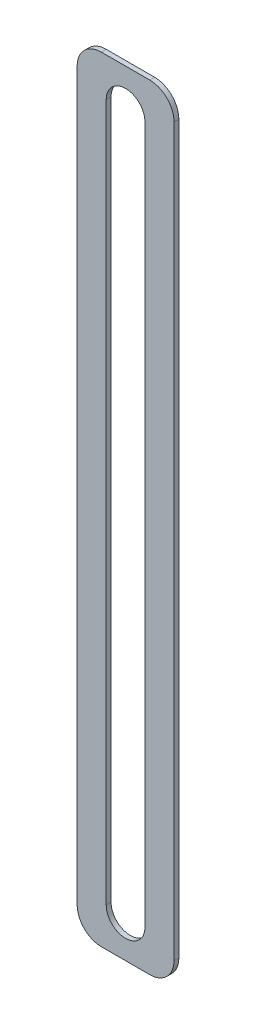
ISO-10303-21;
HEADER;
FILE_DESCRIPTION(('STEP AP214'),'2;1');
FILE_NAME('part.step','',(''),(''),'','','');
FILE_SCHEMA(('AUTOMOTIVE_DESIGN { 1 0 10303 214 1 1 1 1 }'));
ENDSEC;
DATA;
#1=APPLICATION_CONTEXT('core data for automotive mechanical design processes');
#2=APPLICATION_PROTOCOL_DEFINITION('international standard','automotive_design',2000,#1);
#3=PRODUCT_CONTEXT('',#1,'mechanical');
#4=PRODUCT('Part','Part','',(#3));
#5=PRODUCT_RELATED_PRODUCT_CATEGORY('part','',(#4));
#6=PRODUCT_DEFINITION_FORMATION('','',#4);
#7=PRODUCT_DEFINITION_CONTEXT('part definition',#1,'design');
#8=PRODUCT_DEFINITION('design','',#6,#7);
#9=PRODUCT_DEFINITION_SHAPE('','',#8);
#10=(LENGTH_UNIT() NAMED_UNIT(*) SI_UNIT(.MILLI.,.METRE.));
#11=(NAMED_UNIT(*) PLANE_ANGLE_UNIT() SI_UNIT($,.RADIAN.));
#12=(NAMED_UNIT(*) SI_UNIT($,.STERADIAN.) SOLID_ANGLE_UNIT());
#13=UNCERTAINTY_MEASURE_WITH_UNIT(LENGTH_MEASURE(1.E-05),#10,'distance_accuracy_value','');
#14=(GEOMETRIC_REPRESENTATION_CONTEXT(3) GLOBAL_UNCERTAINTY_ASSIGNED_CONTEXT((#13)) GLOBAL_UNIT_ASSIGNED_CONTEXT((#10,
#11,#12)) REPRESENTATION_CONTEXT('',''));
#15=CARTESIAN_POINT('',(0.,0.,0.));
#16=DIRECTION('',(0.,0.,1.));
#17=DIRECTION('',(1.,0.,0.));
#18=AXIS2_PLACEMENT_3D('',#15,#16,#17);
#19=CARTESIAN_POINT('',(2.50000000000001,-37.4999999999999,0.5));
#20=DIRECTION('',(0.,0.,-1.));
#21=DIRECTION('',(-1.,0.,0.));
#22=AXIS2_PLACEMENT_3D('',#19,#20,#21);
#23=CYLINDRICAL_SURFACE('',#22,2.5);
#24=CARTESIAN_POINT('',(2.50000000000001,-37.4999999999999,0.));
#25=DIRECTION('',(0.,0.,-1.));
#26=DIRECTION('',(-1.,0.,0.));
#27=AXIS2_PLACEMENT_3D('',#24,#25,#26);
#28=CIRCLE('',#27,2.5);
#29=CARTESIAN_POINT('',(5.00000000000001,-37.4999999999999,0.));
#30=VERTEX_POINT('',#29);
#31=CARTESIAN_POINT('',(2.50000000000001,-39.9999999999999,0.));
#32=VERTEX_POINT('',#31);
#33=EDGE_CURVE('E212',#30,#32,#28,.T.);
#34=ORIENTED_EDGE('',*,*,#33,.F.);
#35=DIRECTION('',(0.,0.,-1.));
#36=VECTOR('',#35,1.);
#37=CARTESIAN_POINT('',(5.00000000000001,-37.4999999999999,0.5));
#38=LINE('',#37,#36);
#39=CARTESIAN_POINT('',(5.00000000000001,-37.4999999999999,0.5));
#40=VERTEX_POINT('',#39);
#41=EDGE_CURVE('E12',#40,#30,#38,.T.);
#42=ORIENTED_EDGE('',*,*,#41,.F.);
#43=CARTESIAN_POINT('',(2.50000000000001,-37.4999999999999,0.5));
#44=DIRECTION('',(0.,0.,-1.));
#45=DIRECTION('',(-1.,0.,0.));
#46=AXIS2_PLACEMENT_3D('',#43,#44,#45);
#47=CIRCLE('',#46,2.5);
#48=CARTESIAN_POINT('',(2.50000000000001,-39.9999999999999,0.5));
#49=VERTEX_POINT('',#48);
#50=EDGE_CURVE('E218',#40,#49,#47,.T.);
#51=ORIENTED_EDGE('',*,*,#50,.T.);
#52=DIRECTION('',(0.,0.,-1.));
#53=VECTOR('',#52,1.);
#54=CARTESIAN_POINT('',(2.50000000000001,-39.9999999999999,0.5));
#55=LINE('',#54,#53);
#56=EDGE_CURVE('E84',#49,#32,#55,.T.);
#57=ORIENTED_EDGE('',*,*,#56,.T.);
#58=EDGE_LOOP('',(#34,#42,#51,#57));
#59=FACE_BOUND('',#58,.T.);
#60=ADVANCED_FACE('F81',(#59),#23,.T.);
#61=CARTESIAN_POINT('',(5.,37.5000000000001,0.5));
#62=DIRECTION('',(1.,0.,0.));
#63=DIRECTION('',(0.,1.,0.));
#64=AXIS2_PLACEMENT_3D('',#61,#62,#63);
#65=PLANE('',#64);
#66=DIRECTION('',(0.,-1.,0.));
#67=VECTOR('',#66,1.);
#68=CARTESIAN_POINT('',(5.,37.5000000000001,0.));
#69=LINE('',#68,#67);
#70=CARTESIAN_POINT('',(5.,37.5000000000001,0.));
#71=VERTEX_POINT('',#70);
#72=EDGE_CURVE('E223',#71,#30,#69,.T.);
#73=ORIENTED_EDGE('',*,*,#72,.F.);
#74=DIRECTION('',(0.,0.,-1.));
#75=VECTOR('',#74,1.);
#76=CARTESIAN_POINT('',(5.,37.5000000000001,0.5));
#77=LINE('',#76,#75);
#78=CARTESIAN_POINT('',(5.,37.5000000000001,0.5));
#79=VERTEX_POINT('',#78);
#80=EDGE_CURVE('E90',#79,#71,#77,.T.);
#81=ORIENTED_EDGE('',*,*,#80,.F.);
#82=DIRECTION('',(0.,-1.,0.));
#83=VECTOR('',#82,1.);
#84=CARTESIAN_POINT('',(5.,37.5000000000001,0.5));
#85=LINE('',#84,#83);
#86=EDGE_CURVE('E243',#79,#40,#85,.T.);
#87=ORIENTED_EDGE('',*,*,#86,.T.);
#88=ORIENTED_EDGE('',*,*,#41,.T.);
#89=EDGE_LOOP('',(#73,#81,#87,#88));
#90=FACE_BOUND('',#89,.T.);
#91=ADVANCED_FACE('F308',(#90),#65,.T.);
#92=CARTESIAN_POINT('',(2.5,37.5000000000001,0.5));
#93=DIRECTION('',(0.,0.,-1.));
#94=DIRECTION('',(-1.,0.,0.));
#95=AXIS2_PLACEMENT_3D('',#92,#93,#94);
#96=CYLINDRICAL_SURFACE('',#95,2.5);
#97=CARTESIAN_POINT('',(2.5,37.5000000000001,0.));
#98=DIRECTION('',(0.,0.,-1.));
#99=DIRECTION('',(-1.,0.,0.));
#100=AXIS2_PLACEMENT_3D('',#97,#98,#99);
#101=CIRCLE('',#100,2.5);
#102=CARTESIAN_POINT('',(2.5,40.0000000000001,0.));
#103=VERTEX_POINT('',#102);
#104=EDGE_CURVE('E267',#103,#71,#101,.T.);
#105=ORIENTED_EDGE('',*,*,#104,.F.);
#106=DIRECTION('',(0.,0.,-1.));
#107=VECTOR('',#106,1.);
#108=CARTESIAN_POINT('',(2.5,40.0000000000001,0.5));
#109=LINE('',#108,#107);
#110=CARTESIAN_POINT('',(2.5,40.0000000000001,0.5));
#111=VERTEX_POINT('',#110);
#112=EDGE_CURVE('E276',#111,#103,#109,.T.);
#113=ORIENTED_EDGE('',*,*,#112,.F.);
#114=CARTESIAN_POINT('',(2.5,37.5000000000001,0.5));
#115=DIRECTION('',(0.,0.,-1.));
#116=DIRECTION('',(-1.,0.,0.));
#117=AXIS2_PLACEMENT_3D('',#114,#115,#116);
#118=CIRCLE('',#117,2.5);
#119=EDGE_CURVE('E239',#111,#79,#118,.T.);
#120=ORIENTED_EDGE('',*,*,#119,.T.);
#121=ORIENTED_EDGE('',*,*,#80,.T.);
#122=EDGE_LOOP('',(#105,#113,#120,#121));
#123=FACE_BOUND('',#122,.T.);
#124=ADVANCED_FACE('F329',(#123),#96,.T.);
#125=CARTESIAN_POINT('',(2.5,40.0000000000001,0.5));
#126=DIRECTION('',(0.,-1.,0.));
#127=DIRECTION('',(0.,0.,-1.));
#128=AXIS2_PLACEMENT_3D('',#125,#126,#127);
#129=PLANE('',#128);
#130=DIRECTION('',(-1.,0.,0.));
#131=VECTOR('',#130,1.);
#132=CARTESIAN_POINT('',(2.5,40.0000000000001,0.));
#133=LINE('',#132,#131);
#134=CARTESIAN_POINT('',(-2.5,40.0000000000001,0.));
#135=VERTEX_POINT('',#134);
#136=EDGE_CURVE('E264',#103,#135,#133,.T.);
#137=ORIENTED_EDGE('',*,*,#136,.T.);
#138=DIRECTION('',(0.,0.,-1.));
#139=VECTOR('',#138,1.);
#140=CARTESIAN_POINT('',(-2.5,40.0000000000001,0.5));
#141=LINE('',#140,#139);
#142=CARTESIAN_POINT('',(-2.5,40.0000000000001,0.5));
#143=VERTEX_POINT('',#142);
#144=EDGE_CURVE('E279',#143,#135,#141,.T.);
#145=ORIENTED_EDGE('',*,*,#144,.F.);
#146=DIRECTION('',(-1.,0.,0.));
#147=VECTOR('',#146,1.);
#148=CARTESIAN_POINT('',(2.5,40.0000000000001,0.5));
#149=LINE('',#148,#147);
#150=EDGE_CURVE('E236',#111,#143,#149,.T.);
#151=ORIENTED_EDGE('',*,*,#150,.F.);
#152=ORIENTED_EDGE('',*,*,#112,.T.);
#153=EDGE_LOOP('',(#137,#145,#151,#152));
#154=FACE_BOUND('',#153,.T.);
#155=ADVANCED_FACE('F327',(#154),#129,.F.);
#156=CARTESIAN_POINT('',(-2.5,37.5000000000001,0.5));
#157=DIRECTION('',(0.,0.,-1.));
#158=DIRECTION('',(-1.,0.,0.));
#159=AXIS2_PLACEMENT_3D('',#156,#157,#158);
#160=CYLINDRICAL_SURFACE('',#159,2.5);
#161=CARTESIAN_POINT('',(-2.5,37.5000000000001,0.));
#162=DIRECTION('',(0.,0.,1.));
#163=DIRECTION('',(1.,0.,0.));
#164=AXIS2_PLACEMENT_3D('',#161,#162,#163);
#165=CIRCLE('',#164,2.5);
#166=CARTESIAN_POINT('',(-5.,37.5000000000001,0.));
#167=VERTEX_POINT('',#166);
#168=EDGE_CURVE('E261',#135,#167,#165,.T.);
#169=ORIENTED_EDGE('',*,*,#168,.T.);
#170=DIRECTION('',(0.,0.,-1.));
#171=VECTOR('',#170,1.);
#172=CARTESIAN_POINT('',(-5.,37.5000000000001,0.5));
#173=LINE('',#172,#171);
#174=CARTESIAN_POINT('',(-5.,37.5000000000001,0.5));
#175=VERTEX_POINT('',#174);
#176=EDGE_CURVE('E283',#175,#167,#173,.T.);
#177=ORIENTED_EDGE('',*,*,#176,.F.);
#178=CARTESIAN_POINT('',(-2.5,37.5000000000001,0.5));
#179=DIRECTION('',(0.,0.,1.));
#180=DIRECTION('',(1.,0.,0.));
#181=AXIS2_PLACEMENT_3D('',#178,#179,#180);
#182=CIRCLE('',#181,2.5);
#183=EDGE_CURVE('E233',#143,#175,#182,.T.);
#184=ORIENTED_EDGE('',*,*,#183,.F.);
#185=ORIENTED_EDGE('',*,*,#144,.T.);
#186=EDGE_LOOP('',(#169,#177,#184,#185));
#187=FACE_BOUND('',#186,.T.);
#188=ADVANCED_FACE('F323',(#187),#160,.T.);
#189=CARTESIAN_POINT('',(-5.,37.5000000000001,0.5));
#190=DIRECTION('',(1.,0.,0.));
#191=DIRECTION('',(0.,1.,0.));
#192=AXIS2_PLACEMENT_3D('',#189,#190,#191);
#193=PLANE('',#192);
#194=DIRECTION('',(0.,-1.,0.));
#195=VECTOR('',#194,1.);
#196=CARTESIAN_POINT('',(-5.,37.5000000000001,0.));
#197=LINE('',#196,#195);
#198=CARTESIAN_POINT('',(-4.99999999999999,-37.4999999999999,0.));
#199=VERTEX_POINT('',#198);
#200=EDGE_CURVE('E258',#167,#199,#197,.T.);
#201=ORIENTED_EDGE('',*,*,#200,.T.);
#202=DIRECTION('',(0.,0.,-1.));
#203=VECTOR('',#202,1.);
#204=CARTESIAN_POINT('',(-4.99999999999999,-37.4999999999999,0.5));
#205=LINE('',#204,#203);
#206=CARTESIAN_POINT('',(-4.99999999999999,-37.4999999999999,0.5));
#207=VERTEX_POINT('',#206);
#208=EDGE_CURVE('E287',#207,#199,#205,.T.);
#209=ORIENTED_EDGE('',*,*,#208,.F.);
#210=DIRECTION('',(0.,-1.,0.));
#211=VECTOR('',#210,1.);
#212=CARTESIAN_POINT('',(-5.,37.5000000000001,0.5));
#213=LINE('',#212,#211);
#214=EDGE_CURVE('E230',#175,#207,#213,.T.);
#215=ORIENTED_EDGE('',*,*,#214,.F.);
#216=ORIENTED_EDGE('',*,*,#176,.T.);
#217=EDGE_LOOP('',(#201,#209,#215,#216));
#218=FACE_BOUND('',#217,.T.);
#219=ADVANCED_FACE('F319',(#218),#193,.F.);
#220=CARTESIAN_POINT('',(-2.49999999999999,-37.4999999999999,0.5));
#221=DIRECTION('',(0.,0.,-1.));
#222=DIRECTION('',(-1.,0.,0.));
#223=AXIS2_PLACEMENT_3D('',#220,#221,#222);
#224=CYLINDRICAL_SURFACE('',#223,2.5);
#225=CARTESIAN_POINT('',(-2.49999999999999,-37.4999999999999,0.));
#226=DIRECTION('',(0.,0.,1.));
#227=DIRECTION('',(1.,0.,0.));
#228=AXIS2_PLACEMENT_3D('',#225,#226,#227);
#229=CIRCLE('',#228,2.5);
#230=CARTESIAN_POINT('',(-2.49999999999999,-39.9999999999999,0.));
#231=VERTEX_POINT('',#230);
#232=EDGE_CURVE('E254',#199,#231,#229,.T.);
#233=ORIENTED_EDGE('',*,*,#232,.T.);
#234=DIRECTION('',(0.,0.,-1.));
#235=VECTOR('',#234,1.);
#236=CARTESIAN_POINT('',(-2.49999999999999,-39.9999999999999,0.5));
#237=LINE('',#236,#235);
#238=CARTESIAN_POINT('',(-2.49999999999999,-39.9999999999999,0.5));
#239=VERTEX_POINT('',#238);
#240=EDGE_CURVE('E290',#239,#231,#237,.T.);
#241=ORIENTED_EDGE('',*,*,#240,.F.);
#242=CARTESIAN_POINT('',(-2.49999999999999,-37.4999999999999,0.5));
#243=DIRECTION('',(0.,0.,1.));
#244=DIRECTION('',(1.,0.,0.));
#245=AXIS2_PLACEMENT_3D('',#242,#243,#244);
#246=CIRCLE('',#245,2.5);
#247=EDGE_CURVE('E227',#207,#239,#246,.T.);
#248=ORIENTED_EDGE('',*,*,#247,.F.);
#249=ORIENTED_EDGE('',*,*,#208,.T.);
#250=EDGE_LOOP('',(#233,#241,#248,#249));
#251=FACE_BOUND('',#250,.T.);
#252=ADVANCED_FACE('F315',(#251),#224,.T.);
#253=CARTESIAN_POINT('',(2.50000000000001,-39.9999999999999,0.5));
#254=DIRECTION('',(0.,-1.,0.));
#255=DIRECTION('',(0.,0.,-1.));
#256=AXIS2_PLACEMENT_3D('',#253,#254,#255);
#257=PLANE('',#256);
#258=DIRECTION('',(-1.,0.,0.));
#259=VECTOR('',#258,1.);
#260=CARTESIAN_POINT('',(2.50000000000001,-39.9999999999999,0.));
#261=LINE('',#260,#259);
#262=EDGE_CURVE('E250',#32,#231,#261,.T.);
#263=ORIENTED_EDGE('',*,*,#262,.F.);
#264=ORIENTED_EDGE('',*,*,#56,.F.);
#265=DIRECTION('',(-1.,0.,0.));
#266=VECTOR('',#265,1.);
#267=CARTESIAN_POINT('',(2.50000000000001,-39.9999999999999,0.5));
#268=LINE('',#267,#266);
#269=EDGE_CURVE('E222',#49,#239,#268,.T.);
#270=ORIENTED_EDGE('',*,*,#269,.T.);
#271=ORIENTED_EDGE('',*,*,#240,.T.);
#272=EDGE_LOOP('',(#263,#264,#270,#271));
#273=FACE_BOUND('',#272,.T.);
#274=ADVANCED_FACE('F300',(#273),#257,.T.);
#275=CARTESIAN_POINT('',(2.50000000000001,-37.4999999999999,0.5));
#276=DIRECTION('',(0.,0.,-1.));
#277=DIRECTION('',(-1.,0.,0.));
#278=AXIS2_PLACEMENT_3D('',#275,#276,#277);
#279=PLANE('',#278);
#280=DIRECTION('',(0.,1.,0.));
#281=VECTOR('',#280,1.);
#282=CARTESIAN_POINT('',(2.,-36.0000000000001,0.5));
#283=LINE('',#282,#281);
#284=CARTESIAN_POINT('',(2.,-36.0000000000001,0.5));
#285=VERTEX_POINT('',#284);
#286=CARTESIAN_POINT('',(2.,36.0000000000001,0.5));
#287=VERTEX_POINT('',#286);
#288=EDGE_CURVE('E177',#285,#287,#283,.T.);
#289=ORIENTED_EDGE('',*,*,#288,.F.);
#290=CARTESIAN_POINT('',(0.,-36.0000000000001,0.5));
#291=DIRECTION('',(0.,0.,-1.));
#292=DIRECTION('',(-1.,0.,0.));
#293=AXIS2_PLACEMENT_3D('',#290,#291,#292);
#294=CIRCLE('',#293,2.);
#295=CARTESIAN_POINT('',(-1.99999999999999,-36.0000000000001,0.5));
#296=VERTEX_POINT('',#295);
#297=EDGE_CURVE('E173',#285,#296,#294,.T.);
#298=ORIENTED_EDGE('',*,*,#297,.T.);
#299=DIRECTION('',(0.,1.,0.));
#300=VECTOR('',#299,1.);
#301=CARTESIAN_POINT('',(-1.99999999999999,-36.0000000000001,0.5));
#302=LINE('',#301,#300);
#303=CARTESIAN_POINT('',(-2.,36.0000000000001,0.5));
#304=VERTEX_POINT('',#303);
#305=EDGE_CURVE('E180',#296,#304,#302,.T.);
#306=ORIENTED_EDGE('',*,*,#305,.T.);
#307=CARTESIAN_POINT('',(0.,36.0000000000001,0.5));
#308=DIRECTION('',(0.,0.,1.));
#309=DIRECTION('',(1.,0.,0.));
#310=AXIS2_PLACEMENT_3D('',#307,#308,#309);
#311=CIRCLE('',#310,2.);
#312=EDGE_CURVE('E185',#287,#304,#311,.T.);
#313=ORIENTED_EDGE('',*,*,#312,.F.);
#314=EDGE_LOOP('',(#289,#298,#306,#313));
#315=FACE_BOUND('',#314,.T.);
#316=ORIENTED_EDGE('',*,*,#50,.F.);
#317=ORIENTED_EDGE('',*,*,#86,.F.);
#318=ORIENTED_EDGE('',*,*,#119,.F.);
#319=ORIENTED_EDGE('',*,*,#150,.T.);
#320=ORIENTED_EDGE('',*,*,#183,.T.);
#321=ORIENTED_EDGE('',*,*,#214,.T.);
#322=ORIENTED_EDGE('',*,*,#247,.T.);
#323=ORIENTED_EDGE('',*,*,#269,.F.);
#324=EDGE_LOOP('',(#316,#317,#318,#319,#320,#321,#322,#323));
#325=FACE_BOUND('',#324,.T.);
#326=ADVANCED_FACE('F187',(#315,#325),#279,.F.);
#327=CARTESIAN_POINT('',(2.50000000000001,-37.4999999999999,0.));
#328=DIRECTION('',(0.,0.,-1.));
#329=DIRECTION('',(-1.,0.,0.));
#330=AXIS2_PLACEMENT_3D('',#327,#328,#329);
#331=PLANE('',#330);
#332=CARTESIAN_POINT('',(0.,-36.0000000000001,0.));
#333=DIRECTION('',(0.,0.,-1.));
#334=DIRECTION('',(-1.,0.,0.));
#335=AXIS2_PLACEMENT_3D('',#332,#333,#334);
#336=CIRCLE('',#335,2.);
#337=CARTESIAN_POINT('',(2.,-36.0000000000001,0.));
#338=VERTEX_POINT('',#337);
#339=CARTESIAN_POINT('',(-1.99999999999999,-36.0000000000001,0.));
#340=VERTEX_POINT('',#339);
#341=EDGE_CURVE('E106',#338,#340,#336,.T.);
#342=ORIENTED_EDGE('',*,*,#341,.F.);
#343=DIRECTION('',(0.,1.,0.));
#344=VECTOR('',#343,1.);
#345=CARTESIAN_POINT('',(2.,-36.0000000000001,0.));
#346=LINE('',#345,#344);
#347=CARTESIAN_POINT('',(2.,36.0000000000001,0.));
#348=VERTEX_POINT('',#347);
#349=EDGE_CURVE('E190',#338,#348,#346,.T.);
#350=ORIENTED_EDGE('',*,*,#349,.T.);
#351=CARTESIAN_POINT('',(0.,36.0000000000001,0.));
#352=DIRECTION('',(0.,0.,1.));
#353=DIRECTION('',(1.,0.,0.));
#354=AXIS2_PLACEMENT_3D('',#351,#352,#353);
#355=CIRCLE('',#354,2.);
#356=CARTESIAN_POINT('',(-2.,36.0000000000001,0.));
#357=VERTEX_POINT('',#356);
#358=EDGE_CURVE('E194',#348,#357,#355,.T.);
#359=ORIENTED_EDGE('',*,*,#358,.T.);
#360=DIRECTION('',(0.,1.,0.));
#361=VECTOR('',#360,1.);
#362=CARTESIAN_POINT('',(-1.99999999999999,-36.0000000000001,0.));
#363=LINE('',#362,#361);
#364=EDGE_CURVE('E203',#340,#357,#363,.T.);
#365=ORIENTED_EDGE('',*,*,#364,.F.);
#366=EDGE_LOOP('',(#342,#350,#359,#365));
#367=FACE_BOUND('',#366,.T.);
#368=ORIENTED_EDGE('',*,*,#33,.T.);
#369=ORIENTED_EDGE('',*,*,#262,.T.);
#370=ORIENTED_EDGE('',*,*,#232,.F.);
#371=ORIENTED_EDGE('',*,*,#200,.F.);
#372=ORIENTED_EDGE('',*,*,#168,.F.);
#373=ORIENTED_EDGE('',*,*,#136,.F.);
#374=ORIENTED_EDGE('',*,*,#104,.T.);
#375=ORIENTED_EDGE('',*,*,#72,.T.);
#376=EDGE_LOOP('',(#368,#369,#370,#371,#372,#373,#374,#375));
#377=FACE_BOUND('',#376,.T.);
#378=ADVANCED_FACE('F303',(#367,#377),#331,.T.);
#379=CARTESIAN_POINT('',(0.,-36.0000000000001,0.5));
#380=DIRECTION('',(0.,0.,-1.));
#381=DIRECTION('',(-1.,0.,0.));
#382=AXIS2_PLACEMENT_3D('',#379,#380,#381);
#383=CYLINDRICAL_SURFACE('',#382,2.);
#384=ORIENTED_EDGE('',*,*,#341,.T.);
#385=DIRECTION('',(0.,0.,-1.));
#386=VECTOR('',#385,1.);
#387=CARTESIAN_POINT('',(-1.99999999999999,-36.0000000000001,0.5));
#388=LINE('',#387,#386);
#389=EDGE_CURVE('E170',#296,#340,#388,.T.);
#390=ORIENTED_EDGE('',*,*,#389,.F.);
#391=ORIENTED_EDGE('',*,*,#297,.F.);
#392=DIRECTION('',(0.,0.,-1.));
#393=VECTOR('',#392,1.);
#394=CARTESIAN_POINT('',(2.,-36.0000000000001,0.5));
#395=LINE('',#394,#393);
#396=EDGE_CURVE('E209',#285,#338,#395,.T.);
#397=ORIENTED_EDGE('',*,*,#396,.T.);
#398=EDGE_LOOP('',(#384,#390,#391,#397));
#399=FACE_BOUND('',#398,.T.);
#400=ADVANCED_FACE('F171',(#399),#383,.F.);
#401=CARTESIAN_POINT('',(2.,-36.0000000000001,0.5));
#402=DIRECTION('',(-1.,0.,0.));
#403=DIRECTION('',(0.,0.,1.));
#404=AXIS2_PLACEMENT_3D('',#401,#402,#403);
#405=PLANE('',#404);
#406=ORIENTED_EDGE('',*,*,#349,.F.);
#407=ORIENTED_EDGE('',*,*,#396,.F.);
#408=ORIENTED_EDGE('',*,*,#288,.T.);
#409=DIRECTION('',(0.,0.,-1.));
#410=VECTOR('',#409,1.);
#411=CARTESIAN_POINT('',(2.,36.0000000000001,0.5));
#412=LINE('',#411,#410);
#413=EDGE_CURVE('E213',#287,#348,#412,.T.);
#414=ORIENTED_EDGE('',*,*,#413,.T.);
#415=EDGE_LOOP('',(#406,#407,#408,#414));
#416=FACE_BOUND('',#415,.T.);
#417=ADVANCED_FACE('F421',(#416),#405,.T.);
#418=CARTESIAN_POINT('',(0.,36.0000000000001,0.5));
#419=DIRECTION('',(0.,0.,-1.));
#420=DIRECTION('',(-1.,0.,0.));
#421=AXIS2_PLACEMENT_3D('',#418,#419,#420);
#422=CYLINDRICAL_SURFACE('',#421,2.);
#423=ORIENTED_EDGE('',*,*,#358,.F.);
#424=ORIENTED_EDGE('',*,*,#413,.F.);
#425=ORIENTED_EDGE('',*,*,#312,.T.);
#426=DIRECTION('',(0.,0.,-1.));
#427=VECTOR('',#426,1.);
#428=CARTESIAN_POINT('',(-2.,36.0000000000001,0.5));
#429=LINE('',#428,#427);
#430=EDGE_CURVE('E98',#304,#357,#429,.T.);
#431=ORIENTED_EDGE('',*,*,#430,.T.);
#432=EDGE_LOOP('',(#423,#424,#425,#431));
#433=FACE_BOUND('',#432,.T.);
#434=ADVANCED_FACE('F431',(#433),#422,.F.);
#435=CARTESIAN_POINT('',(-1.99999999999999,-36.0000000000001,0.5));
#436=DIRECTION('',(-1.,0.,0.));
#437=DIRECTION('',(0.,-1.,0.));
#438=AXIS2_PLACEMENT_3D('',#435,#436,#437);
#439=PLANE('',#438);
#440=ORIENTED_EDGE('',*,*,#364,.T.);
#441=ORIENTED_EDGE('',*,*,#430,.F.);
#442=ORIENTED_EDGE('',*,*,#305,.F.);
#443=ORIENTED_EDGE('',*,*,#389,.T.);
#444=EDGE_LOOP('',(#440,#441,#442,#443));
#445=FACE_BOUND('',#444,.T.);
#446=ADVANCED_FACE('F181',(#445),#439,.F.);
#447=CLOSED_SHELL('',(#60,#91,#124,#155,#188,#219,#252,#274,#326,#378,#400,#417,#434,#446));
#448=MANIFOLD_SOLID_BREP('B2',#447);
#449=ADVANCED_BREP_SHAPE_REPRESENTATION('',(#18,#448),#14);
#450=SHAPE_DEFINITION_REPRESENTATION(#9,#449);
ENDSEC;
END-ISO-10303-21;
